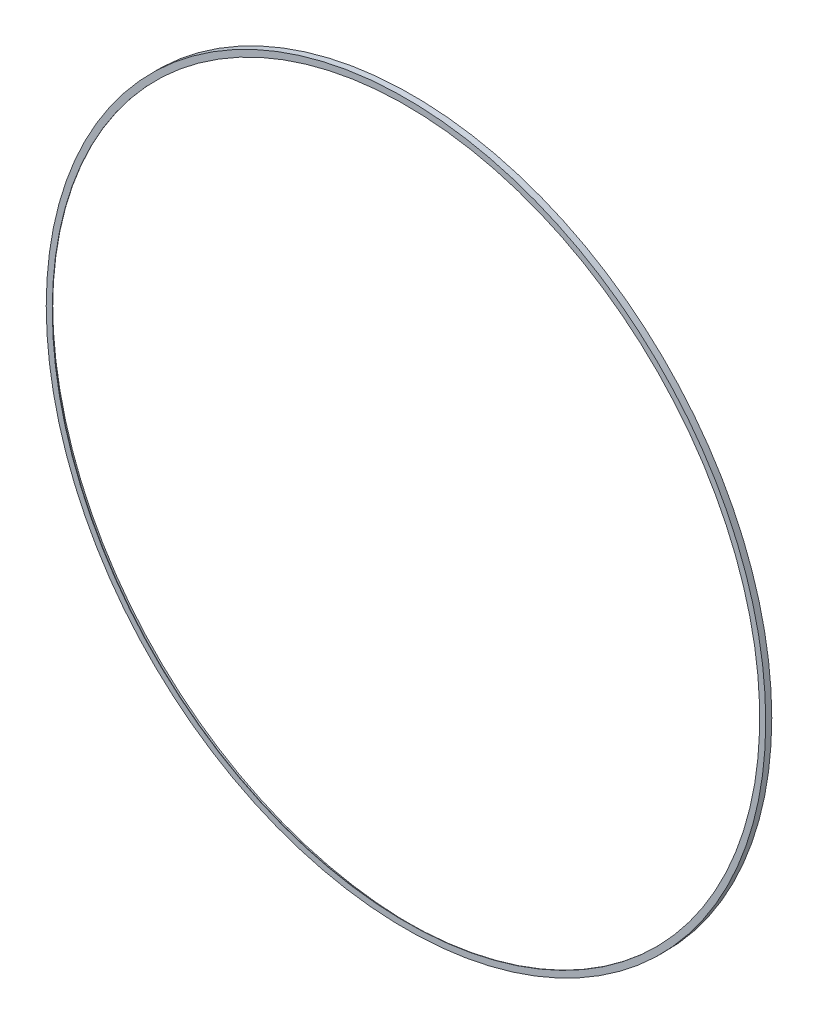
ISO-10303-21;
HEADER;
FILE_DESCRIPTION(('STEP AP214'),'2;1');
FILE_NAME('part.step','',(''),(''),'','','');
FILE_SCHEMA(('AUTOMOTIVE_DESIGN { 1 0 10303 214 1 1 1 1 }'));
ENDSEC;
DATA;
#1=APPLICATION_CONTEXT('core data for automotive mechanical design processes');
#2=APPLICATION_PROTOCOL_DEFINITION('international standard','automotive_design',2000,#1);
#3=PRODUCT_CONTEXT('',#1,'mechanical');
#4=PRODUCT('Part','Part','',(#3));
#5=PRODUCT_RELATED_PRODUCT_CATEGORY('part','',(#4));
#6=PRODUCT_DEFINITION_FORMATION('','',#4);
#7=PRODUCT_DEFINITION_CONTEXT('part definition',#1,'design');
#8=PRODUCT_DEFINITION('design','',#6,#7);
#9=PRODUCT_DEFINITION_SHAPE('','',#8);
#10=(LENGTH_UNIT() NAMED_UNIT(*) SI_UNIT(.MILLI.,.METRE.));
#11=(NAMED_UNIT(*) PLANE_ANGLE_UNIT() SI_UNIT($,.RADIAN.));
#12=(NAMED_UNIT(*) SI_UNIT($,.STERADIAN.) SOLID_ANGLE_UNIT());
#13=UNCERTAINTY_MEASURE_WITH_UNIT(LENGTH_MEASURE(1.E-05),#10,'distance_accuracy_value','');
#14=(GEOMETRIC_REPRESENTATION_CONTEXT(3) GLOBAL_UNCERTAINTY_ASSIGNED_CONTEXT((#13)) GLOBAL_UNIT_ASSIGNED_CONTEXT((#10,
#11,#12)) REPRESENTATION_CONTEXT('',''));
#15=CARTESIAN_POINT('',(0.,0.,0.));
#16=DIRECTION('',(0.,0.,1.));
#17=DIRECTION('',(1.,0.,0.));
#18=AXIS2_PLACEMENT_3D('',#15,#16,#17);
#19=CARTESIAN_POINT('',(0.,0.,-88.99));
#20=DIRECTION('',(0.,0.,-1.));
#21=DIRECTION('',(-1.,0.,0.));
#22=AXIS2_PLACEMENT_3D('',#19,#20,#21);
#23=CYLINDRICAL_SURFACE('',#22,1490.6625);
#24=CARTESIAN_POINT('',(0.,0.,0.));
#25=DIRECTION('',(0.,0.,-1.));
#26=DIRECTION('',(-1.,0.,0.));
#27=AXIS2_PLACEMENT_3D('',#24,#25,#26);
#28=CIRCLE('',#27,1490.6625);
#29=CARTESIAN_POINT('',(-1490.6625,0.,0.));
#30=VERTEX_POINT('',#29);
#31=EDGE_CURVE('E10',#30,#30,#28,.T.);
#32=ORIENTED_EDGE('',*,*,#31,.F.);
#33=EDGE_LOOP('',(#32));
#34=FACE_BOUND('',#33,.T.);
#35=CARTESIAN_POINT('',(0.,0.,-1.58750000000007));
#36=DIRECTION('',(0.,0.,-1.));
#37=DIRECTION('',(-1.,0.,0.));
#38=AXIS2_PLACEMENT_3D('',#35,#36,#37);
#39=CIRCLE('',#38,1490.6625);
#40=CARTESIAN_POINT('',(-1490.6625,0.,-1.58750000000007));
#41=VERTEX_POINT('',#40);
#42=EDGE_CURVE('E53',#41,#41,#39,.T.);
#43=ORIENTED_EDGE('',*,*,#42,.T.);
#44=EDGE_LOOP('',(#43));
#45=FACE_BOUND('',#44,.T.);
#46=ADVANCED_FACE('F31',(#34,#45),#23,.F.);
#47=CARTESIAN_POINT('',(1490.6625,0.,0.));
#48=DIRECTION('',(0.,0.,-1.));
#49=DIRECTION('',(-1.,0.,0.));
#50=AXIS2_PLACEMENT_3D('',#47,#48,#49);
#51=PLANE('',#50);
#52=CARTESIAN_POINT('',(0.,0.,0.));
#53=DIRECTION('',(0.,0.,-1.));
#54=DIRECTION('',(-1.,0.,0.));
#55=AXIS2_PLACEMENT_3D('',#52,#53,#54);
#56=CIRCLE('',#55,1516.0625);
#57=CARTESIAN_POINT('',(-1516.0625,0.,0.));
#58=VERTEX_POINT('',#57);
#59=EDGE_CURVE('E37',#58,#58,#56,.T.);
#60=ORIENTED_EDGE('',*,*,#59,.F.);
#61=EDGE_LOOP('',(#60));
#62=FACE_BOUND('',#61,.T.);
#63=ORIENTED_EDGE('',*,*,#31,.T.);
#64=EDGE_LOOP('',(#63));
#65=FACE_BOUND('',#64,.T.);
#66=ADVANCED_FACE('F78',(#62,#65),#51,.F.);
#67=CARTESIAN_POINT('',(0.,0.,-88.99));
#68=DIRECTION('',(0.,0.,-1.));
#69=DIRECTION('',(-1.,0.,0.));
#70=AXIS2_PLACEMENT_3D('',#67,#68,#69);
#71=CYLINDRICAL_SURFACE('',#70,1516.0625);
#72=CARTESIAN_POINT('',(0.,0.,-25.4));
#73=DIRECTION('',(0.,0.,-1.));
#74=DIRECTION('',(-1.,0.,0.));
#75=AXIS2_PLACEMENT_3D('',#72,#73,#74);
#76=CIRCLE('',#75,1516.0625);
#77=CARTESIAN_POINT('',(-1516.0625,0.,-25.4));
#78=VERTEX_POINT('',#77);
#79=EDGE_CURVE('E41',#78,#78,#76,.T.);
#80=ORIENTED_EDGE('',*,*,#79,.F.);
#81=EDGE_LOOP('',(#80));
#82=FACE_BOUND('',#81,.T.);
#83=ORIENTED_EDGE('',*,*,#59,.T.);
#84=EDGE_LOOP('',(#83));
#85=FACE_BOUND('',#84,.T.);
#86=ADVANCED_FACE('F73',(#82,#85),#71,.T.);
#87=CARTESIAN_POINT('',(1516.0625,0.,-25.4));
#88=DIRECTION('',(0.,0.,1.));
#89=DIRECTION('',(1.,0.,0.));
#90=AXIS2_PLACEMENT_3D('',#87,#88,#89);
#91=PLANE('',#90);
#92=CARTESIAN_POINT('',(0.,0.,-25.4));
#93=DIRECTION('',(0.,0.,-1.));
#94=DIRECTION('',(-1.,0.,0.));
#95=AXIS2_PLACEMENT_3D('',#92,#93,#94);
#96=CIRCLE('',#95,1514.475);
#97=CARTESIAN_POINT('',(-1514.475,0.,-25.4));
#98=VERTEX_POINT('',#97);
#99=EDGE_CURVE('E45',#98,#98,#96,.T.);
#100=ORIENTED_EDGE('',*,*,#99,.F.);
#101=EDGE_LOOP('',(#100));
#102=FACE_BOUND('',#101,.T.);
#103=ORIENTED_EDGE('',*,*,#79,.T.);
#104=EDGE_LOOP('',(#103));
#105=FACE_BOUND('',#104,.T.);
#106=ADVANCED_FACE('F67',(#102,#105),#91,.F.);
#107=CARTESIAN_POINT('',(0.,0.,-88.99));
#108=DIRECTION('',(0.,0.,-1.));
#109=DIRECTION('',(-1.,0.,0.));
#110=AXIS2_PLACEMENT_3D('',#107,#108,#109);
#111=CYLINDRICAL_SURFACE('',#110,1514.475);
#112=CARTESIAN_POINT('',(0.,0.,-1.58750000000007));
#113=DIRECTION('',(0.,0.,-1.));
#114=DIRECTION('',(-1.,0.,0.));
#115=AXIS2_PLACEMENT_3D('',#112,#113,#114);
#116=CIRCLE('',#115,1514.475);
#117=CARTESIAN_POINT('',(-1514.475,0.,-1.58750000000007));
#118=VERTEX_POINT('',#117);
#119=EDGE_CURVE('E50',#118,#118,#116,.T.);
#120=ORIENTED_EDGE('',*,*,#119,.F.);
#121=EDGE_LOOP('',(#120));
#122=FACE_BOUND('',#121,.T.);
#123=ORIENTED_EDGE('',*,*,#99,.T.);
#124=EDGE_LOOP('',(#123));
#125=FACE_BOUND('',#124,.T.);
#126=ADVANCED_FACE('F61',(#122,#125),#111,.F.);
#127=CARTESIAN_POINT('',(1514.475,0.,-1.58750000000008));
#128=DIRECTION('',(0.,0.,1.));
#129=DIRECTION('',(1.,0.,0.));
#130=AXIS2_PLACEMENT_3D('',#127,#128,#129);
#131=PLANE('',#130);
#132=ORIENTED_EDGE('',*,*,#42,.F.);
#133=EDGE_LOOP('',(#132));
#134=FACE_BOUND('',#133,.T.);
#135=ORIENTED_EDGE('',*,*,#119,.T.);
#136=EDGE_LOOP('',(#135));
#137=FACE_BOUND('',#136,.T.);
#138=ADVANCED_FACE('F58',(#134,#137),#131,.F.);
#139=CLOSED_SHELL('',(#46,#66,#86,#106,#126,#138));
#140=MANIFOLD_SOLID_BREP('B2',#139);
#141=ADVANCED_BREP_SHAPE_REPRESENTATION('',(#18,#140),#14);
#142=SHAPE_DEFINITION_REPRESENTATION(#9,#141);
ENDSEC;
END-ISO-10303-21;
